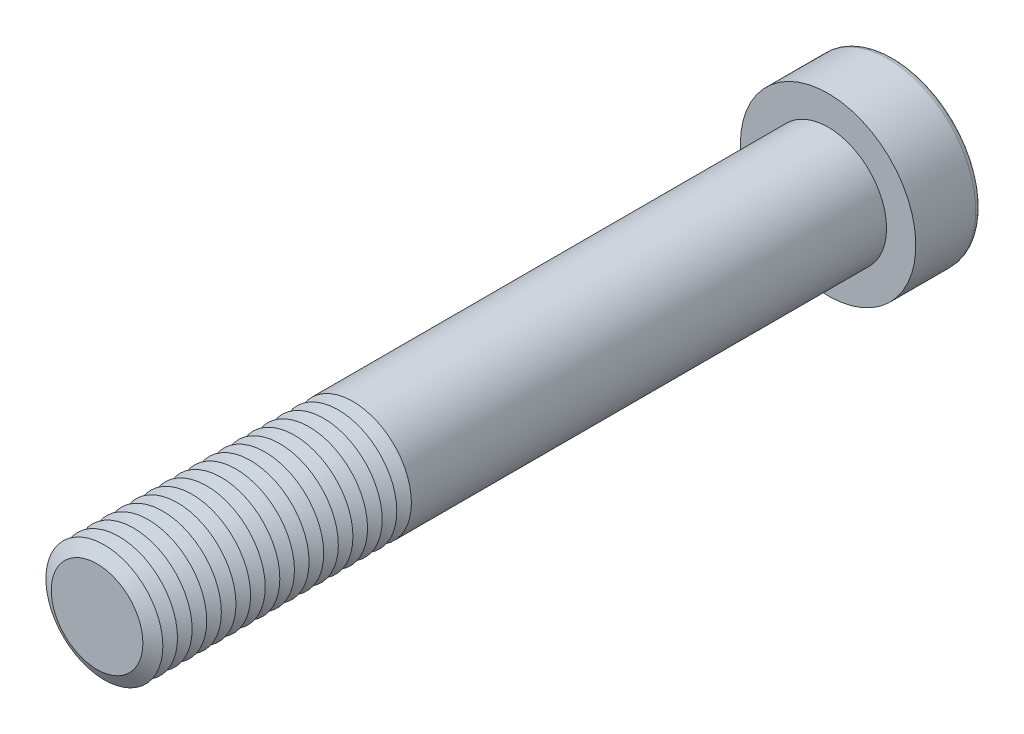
from build123d import *

# Parameters (mm, degrees)
SKETCH1_R           = 8
BOSS_EXTRUDE1_DEPTH = 100
SKETCH2_R           = 12
BOSS_EXTRUDE2_DEPTH = 9
CUT_EXTRUDE1_DEPTH  = 9
FILLET1_R           = 0.8
LPATTERN1_COUNT     = 18
LPATTERN1_PITCH     = 2


with BuildPart() as part:
    # Sketch1 → Boss-Extrude1 (new body)
    with BuildSketch(Plane.XY):
        Circle(SKETCH1_R)
    extrude(amount=BOSS_EXTRUDE1_DEPTH)

    # Sketch2 → Boss-Extrude2 (add)
    with BuildSketch(Plane(origin=(0, 0, 0), x_dir=(-1, 0, 0), z_dir=(0, 0, -1))):
        Circle(SKETCH2_R)
    extrude(amount=BOSS_EXTRUDE2_DEPTH)

    # Sketch3 → Cut-Extrude1 (cut)
    with BuildSketch(Plane(origin=(0, 0, -9), x_dir=(-1, 0, 0), z_dir=(0, 0, -1))):
        Polygon((-3.464101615, 6), (-6.92820323, 0), (-3.464101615, -6), (3.464101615, -6), (6.92820323, 0), (3.464101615, 6), align=None)
    extrude(amount=-CUT_EXTRUDE1_DEPTH, mode=Mode.SUBTRACT)

    # Fillet1
    fillet1_edges = [part.edges().sort_by_distance(p)[0] for p in [
        (12, 0, -9),
    ]]
    fillet(fillet1_edges, radius=FILLET1_R)

    # Cut-Extrude2 cone 1 section (on through the dimple's axis) → Cut-Extrude2 (revolve, cut)
    with BuildSketch(Plane.YZ):
        Polygon((0, 0), (6, 0), (0, 3.464101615), align=None)
    revolve(axis=Axis((0, 0, 0), (0, 0, 1)), mode=Mode.SUBTRACT)

    # Cut-Extrude3 cone 1 section (on through the dimple's axis) → Cut-Extrude3 (revolve, cut)
    with BuildSketch(Plane(origin=(0, 0, -9), x_dir=(0, 1, 0), z_dir=(1, 0, 0))):
        Polygon((0, 0), (6.92820323, 0), (0, 1.856406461), align=None)
    revolve(axis=Axis((0, 0, -9), (0, 0, 1)), mode=Mode.SUBTRACT)

    # Sketch7 → Cut-Revolve1 (revolve, cut)
    with BuildSketch(Plane(origin=(0, 0, 0), x_dir=(0, 0, -1), z_dir=(1, 0, 0)), mode=Mode.PRIVATE) as cut_revolve1_sk:
        Polygon((-100, 6.267949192), (-99, 8), (-101, 8), align=None)
    cut_revolve1 = revolve(cut_revolve1_sk.sketch.rotate(Axis((0, 0, 100), (0, 0, -1)), 90), axis=Axis((0, 0, 100), (0, 0, -1)), mode=Mode.SUBTRACT)

    # LPattern1: Cut-Revolve1 ×18
    with Locations(*[(0, 0, -i * LPATTERN1_PITCH) for i in range(1, LPATTERN1_COUNT)]):
        add(cut_revolve1, mode=Mode.SUBTRACT)


solid = part.part
